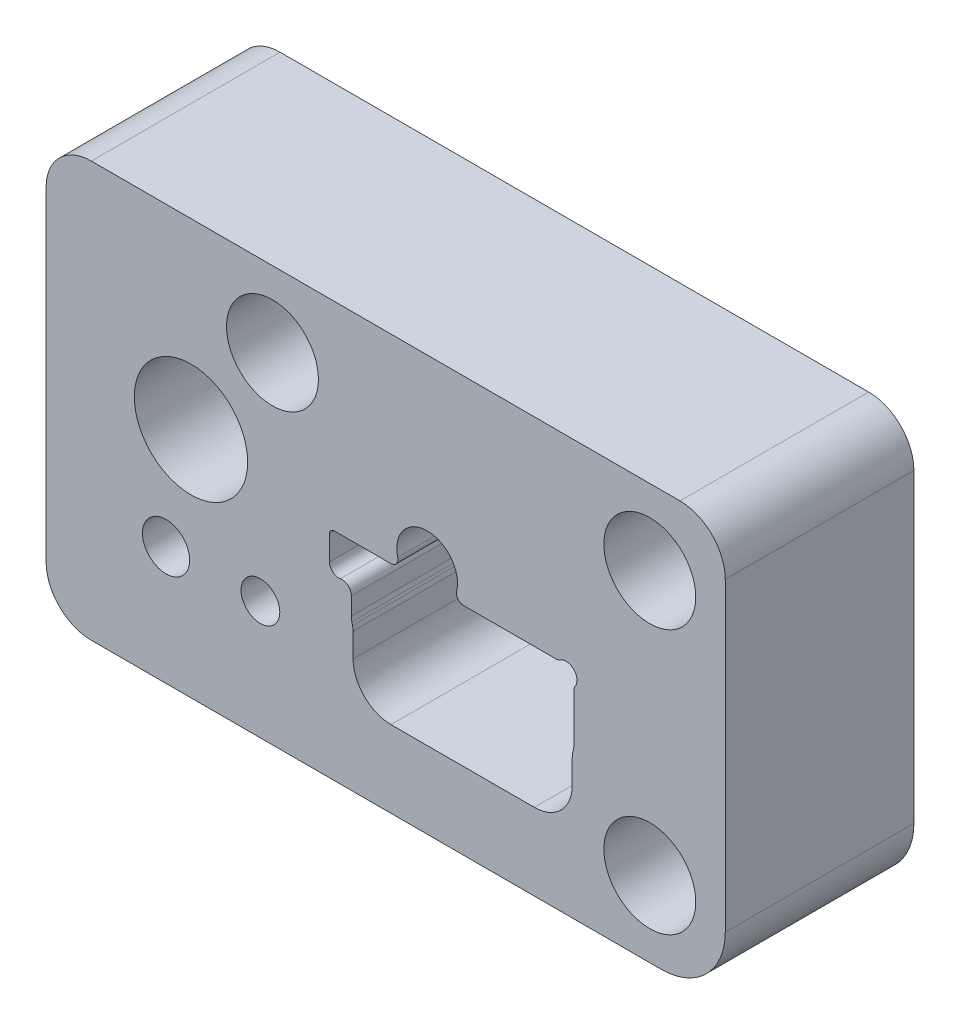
from build123d import *

# Parameters (mm, degrees)
BOSS_EXTRUDE1_DEPTH                                = 31.75
HOLE1_D                                            = 10.3124
HOLE1_CBORE_D                                      = 15.4686
HOLE1_CBORE_DEPTH                                  = 17.526
SKETCH6_R                                          = 9.5377
CUT_EXTRUDE2_DEPTH                                 = 241.675890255
HOLE12_D                                           = 6.5278
HOLE13_D                                           = 7.9375
CUT_EXTRUDE1_QU250515L_PUNCH_MOUNTED_IN_DEPTH      = 241.094037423
CUT_EXTRUDE1_QU250515L_PUNCH_MOUNTED_IN_DEPTH_BACK = 241.094037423
CUT_EXTRUDE3_DEPTH                                 = 241.675890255


with BuildPart() as part:
    # Sketch1 → Boss-Extrude1 (new body)
    with BuildSketch(Plane.XY):
        with BuildLine():
            Line((-200.025, -47.625), (-100.965, -47.625))
            ThreePointArc((-100.965, -47.625), (-95.576846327, -49.856846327), (-93.345, -55.245))
            Line((-93.345, -55.245), (-93.345, -106.68))
            ThreePointArc((-93.345, -106.68), (-96.506782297, -114.313217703), (-104.14, -117.475))
            Line((-104.14, -117.475), (-200.025, -117.475))
            ThreePointArc((-200.025, -117.475), (-205.413153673, -115.243153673), (-207.645, -109.855))
            Line((-207.645, -109.855), (-207.645, -55.245))
            ThreePointArc((-207.645, -55.245), (-205.413153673, -49.856846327), (-200.025, -47.625))
        make_face()
    extrude(amount=-BOSS_EXTRUDE1_DEPTH)

    # Hole1 (through all)
    with Locations(Plane(origin=(-74.464107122, -53.040000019, 0), x_dir=(1, 0, 0), z_dir=(0, 0, 1))):
        with Locations((-31.580892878, -7.284999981), (-31.580892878, -51.734999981), (-95.080892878, -7.284999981)):
            CounterBoreHole(HOLE1_D / 2, HOLE1_CBORE_D / 2, HOLE1_CBORE_DEPTH)

    # Sketch6 → Cut-Extrude2 (cut, through all)
    with BuildSketch(Plane.XY):
        with Locations((-183.261, -78.359)):
            Circle(SKETCH6_R)
    extrude(amount=-CUT_EXTRUDE2_DEPTH, mode=Mode.SUBTRACT)

    # Hole12 (through all)
    with Locations(Plane(origin=(-173.993887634, -87.930254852, 0), x_dir=(-1, 0, 0), z_dir=(0, 0, 1))):
        with Locations((-2.416887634, 9.605745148)):
            Hole(HOLE12_D / 2)

    # Hole13 (through all)
    with Locations(Plane(origin=(-183.797739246, -86.934859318, -31.75), x_dir=(-1, 0, 0), z_dir=(0, 0, -1))):
        with Locations((3.654260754, -10.601140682)):
            Hole(HOLE13_D / 2)

    # Sketch1 QU250515L_Punch_Mounted in the s → Cut-Extrude1 QU250515L_Punch_Mounted in (cut, two sides: drawn at the far end of the back side and taken through both)
    with BuildSketch(Plane.XY.offset(-4.7625).offset(-CUT_EXTRUDE1_QU250515L_PUNCH_MOUNTED_IN_DEPTH_BACK)):
        with BuildLine():
            Line((-159.765315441, -82.447253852), (-157.68678265, -84.924352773))
            ThreePointArc((-157.68678265, -84.924352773), (-156.639691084, -86.737968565), (-156.27604, -88.800336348))
            Line((-156.27604, -88.800336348), (-156.27604, -92.034371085))
            ThreePointArc((-156.27604, -92.034371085), (-156.25214067, -92.453264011), (-156.180752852, -92.866720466))
            Line((-156.180752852, -92.866720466), (-156.076687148, -93.315279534))
            ThreePointArc((-156.076687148, -93.315279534), (-156.00529933, -93.728735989), (-155.9814, -94.147628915))
            Line((-155.9814, -94.147628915), (-155.9814, -98.171))
            ThreePointArc((-155.9814, -98.171), (-154.114088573, -102.679088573), (-149.606, -104.5464))
            Line((-149.606, -104.5464), (-125.476, -104.5464))
            ThreePointArc((-125.476, -104.5464), (-120.967911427, -102.679088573), (-119.1006, -98.171))
            Line((-119.1006, -98.171), (-119.1006, -94.147628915))
            ThreePointArc((-119.1006, -94.147628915), (-119.07670067, -93.728735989), (-119.005312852, -93.315279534))
            Line((-119.005312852, -93.315279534), (-118.901247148, -92.866720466))
            ThreePointArc((-118.901247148, -92.866720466), (-118.82985933, -92.453264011), (-118.80596, -92.034371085))
            Line((-118.80596, -92.034371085), (-118.80596, -84.107845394))
            ThreePointArc((-118.80596, -84.107845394), (-118.754703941, -83.760292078), (-118.6053, -83.442331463))
            ThreePointArc((-118.6053, -83.442331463), (-118.838066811, -81.119066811), (-121.161331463, -80.8863))
            ThreePointArc((-121.161331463, -80.8863), (-121.479292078, -81.035703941), (-121.826845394, -81.08696))
            Line((-121.826845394, -81.08696), (-137.384846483, -81.08696))
            ThreePointArc((-137.384846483, -81.08696), (-138.333399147, -80.624463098), (-138.553185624, -79.592305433))
            ThreePointArc((-138.553185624, -79.592305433), (-143.51, -73.25106), (-148.466814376, -79.592305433))
            ThreePointArc((-148.466814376, -79.592305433), (-148.686600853, -80.624463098), (-149.635153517, -81.08696))
            Line((-149.635153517, -81.08696), (-159.131, -81.08696))
            ThreePointArc((-159.131, -81.08696), (-159.8814591, -81.565055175), (-159.765315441, -82.447253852))
        make_face()
    extrude(amount=CUT_EXTRUDE1_QU250515L_PUNCH_MOUNTED_IN_DEPTH + CUT_EXTRUDE1_QU250515L_PUNCH_MOUNTED_IN_DEPTH_BACK, mode=Mode.SUBTRACT)

    # Sketch7 → Cut-Extrude3 (cut, through all)
    with BuildSketch(Plane.XY):
        with BuildLine():
            Line((-159.95904, -81.915), (-159.95904, -85.979))
            ThreePointArc((-159.95904, -85.979), (-159.400357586, -87.188003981), (-158.11754, -87.54604826))
            ThreePointArc((-158.11754, -87.54604826), (-156.834722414, -87.90409254), (-156.27604, -89.113096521))
            Line((-156.27604, -89.113096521), (-156.27604, -88.800336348))
            ThreePointArc((-156.27604, -88.800336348), (-156.639691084, -86.737968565), (-157.68678265, -84.924352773))
            Line((-157.68678265, -84.924352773), (-159.765315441, -82.447253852))
            ThreePointArc((-159.765315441, -82.447253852), (-159.909103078, -82.198206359), (-159.95904, -81.915))
        make_face()
    extrude(amount=-CUT_EXTRUDE3_DEPTH, mode=Mode.SUBTRACT)


solid = part.part
